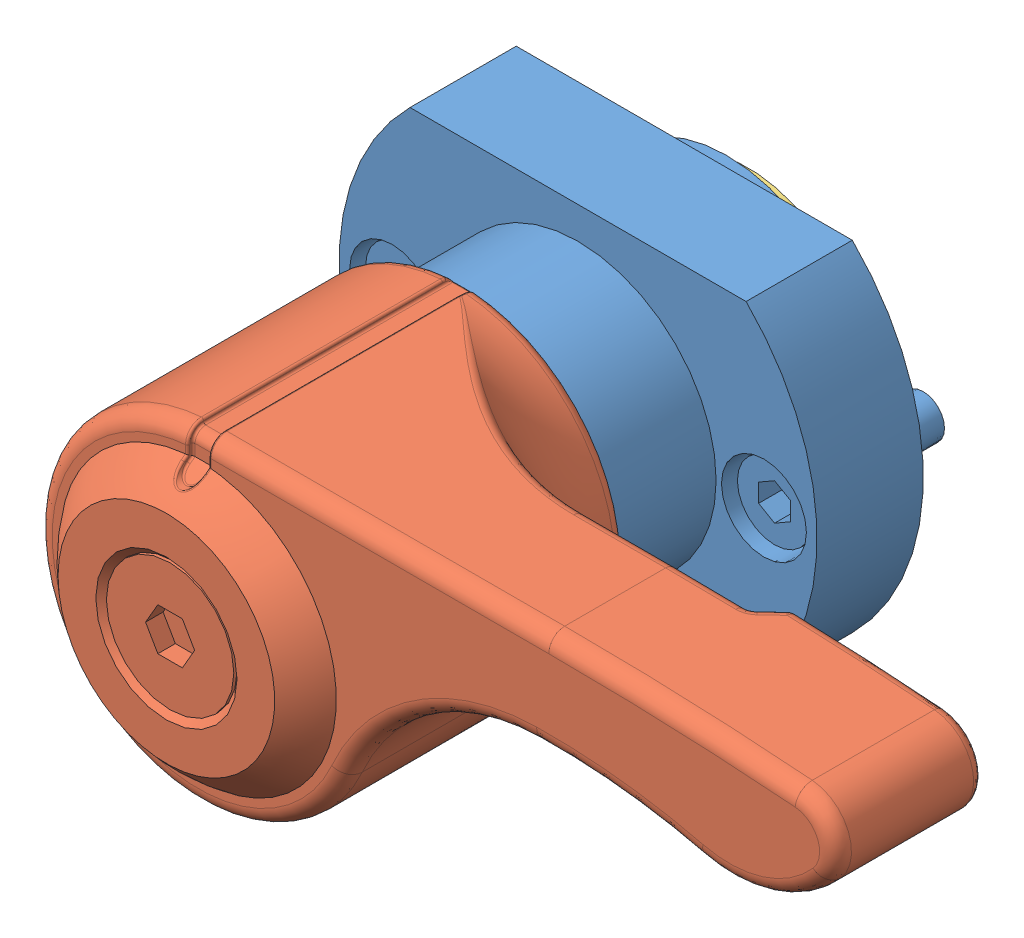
SolidWorks assembly QCPSS2245-6-S-D.SLDASM, configuration Default (file format 15000). Lengths in mm.
Overall size (82.5 32.75 54.76).
3 component instances, 3 part files, 0 mates.
Components (placement in the parent):
- QCPSS2245-6-S-D_01-1: QCPSS2245-6-S-D_01.sldprt [ﾃﾞﾌｫﾙﾄ] x (1 0 0) z (0 0 -1) size (45 32 37.5)
- QCPSS2245-6-S-D_02-1: QCPSS2245-6-S-D_02.sldprt [ﾃﾞﾌｫﾙﾄ] at (0 0 -6) x (1 0 0) z (0 0 -1) size (75.25 32 46.19)
- QCPSS2245-6-S-D_03-1: QCPSS2245-6-S-D_03.sldprt [ﾃﾞﾌｫﾙﾄ] at (0 0 -6) x (1 0 0) z (0 0 -1) size (22 22 50)
